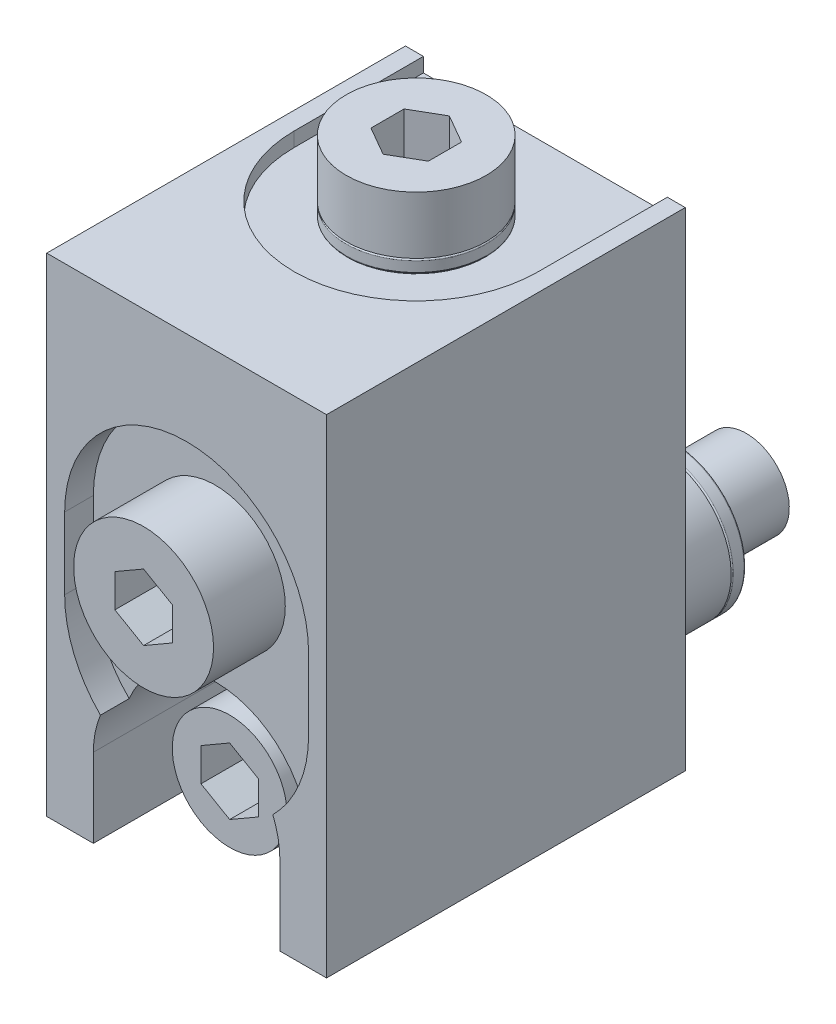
from build123d import *

# Parameters (mm, degrees)
SKETCH1_W           = 19.5
SKETCH1_H           = 34
BOSS_EXTRUDE1_DEPTH = 25
CUT_EXTRUDE1_DEPTH  = 10
CUT_EXTRUDE2_DEPTH  = 2
CUT_EXTRUDE3_DEPTH  = 1
SKETCH5_R           = 4
BOSS_EXTRUDE2_DEPTH = 7
SKETCH6_R           = 4.875
BOSS_EXTRUDE3_DEPTH = 5
SKETCH7_R           = 4.875
BOSS_EXTRUDE4_DEPTH = 5
CUT_EXTRUDE4_DEPTH  = 5
CUT_EXTRUDE5_DEPTH  = 3
CUT_EXTRUDE6_DEPTH  = 3
SKETCH16_W          = 0.1
SKETCH16_H          = 0.05
FILLET1_R           = 0.099


with BuildPart() as part:
    # Sketch1 → Boss-Extrude1 (new body)
    with BuildSketch(Plane.XY):
        with Locations((9.75, 17)):
            Rectangle(SKETCH1_W, SKETCH1_H)
    extrude(amount=BOSS_EXTRUDE1_DEPTH)

    # Sketch2 → Cut-Extrude1 (cut)
    with BuildSketch(Plane.XY.offset(25)):
        with BuildLine():
            Line((3.25, 5.5), (3.25, 0))
            Line((3.25, 0), (16.25, 0))
            Line((16.25, 0), (16.25, 5.5))
            ThreePointArc((16.25, 5.5), (9.75, 12), (3.25, 5.5))
        make_face()
    extrude(amount=-CUT_EXTRUDE1_DEPTH, mode=Mode.SUBTRACT)

    # Sketch3 → Cut-Extrude2 (cut)
    with BuildSketch(Plane.XY.offset(25)):
        with BuildLine():
            Line((1.25, 19), (1.25, 14))
            ThreePointArc((1.25, 14), (9.75, 5.5), (18.25, 14))
            Line((18.25, 14), (18.25, 19))
            ThreePointArc((18.25, 19), (9.75, 27.5), (1.25, 19))
        make_face()
    extrude(amount=-CUT_EXTRUDE2_DEPTH, mode=Mode.SUBTRACT)

    # Sketch4 → Cut-Extrude3 (cut)
    with BuildSketch(Plane(origin=(0, 34, 0), x_dir=(1, 0, 0), z_dir=(0, 1, 0))):
        with BuildLine():
            Line((1.25, -9), (1.25, 0))
            Line((1.25, 0), (18.25, 0))
            Line((18.25, 0), (18.25, -9))
            ThreePointArc((18.25, -9), (9.75, -17.5), (1.25, -9))
        make_face()
    extrude(amount=-CUT_EXTRUDE3_DEPTH, mode=Mode.SUBTRACT)

    # Sketch5 → Boss-Extrude2 (add)
    with BuildSketch(Plane.XY.offset(15)):
        with Locations((9.75, 5.5)):
            Circle(SKETCH5_R)
    extrude(amount=BOSS_EXTRUDE2_DEPTH)

    # Sketch6 → Boss-Extrude3 (add)
    with BuildSketch(Plane.XY.offset(23)):
        with Locations((9.75, 19)):
            Circle(SKETCH6_R)
    extrude(amount=BOSS_EXTRUDE3_DEPTH)

    # Sketch7 → Boss-Extrude4 (add)
    with BuildSketch(Plane(origin=(0, 33, 0), x_dir=(1, 0, 0), z_dir=(0, 1, 0))):
        with Locations(Location((9.75, -9, 0), (0, 0, 270))):
            Circle(SKETCH7_R)
    extrude(amount=BOSS_EXTRUDE4_DEPTH)

    # Sketch8 → Cut-Extrude4 (cut)
    with BuildSketch(Plane.XY.offset(22)):
        Polygon((9.75, 3.190598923), (11.75, 4.345299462), (11.75, 6.654700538), (9.75, 7.809401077), (7.75, 6.654700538), (7.75, 4.345299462), align=None)
    extrude(amount=-CUT_EXTRUDE4_DEPTH, mode=Mode.SUBTRACT)

    # Sketch9 → Cut-Extrude5 (cut)
    with BuildSketch(Plane.XY.offset(28)):
        Polygon((9.75, 16.690598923), (11.75, 17.845299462), (11.75, 20.154700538), (9.75, 21.309401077), (7.75, 20.154700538), (7.75, 17.845299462), align=None)
    extrude(amount=-CUT_EXTRUDE5_DEPTH, mode=Mode.SUBTRACT)

    # Sketch10 → Cut-Extrude6 (cut)
    with BuildSketch(Plane(origin=(0, 38, 0), x_dir=(1, 0, 0), z_dir=(0, 1, 0))):
        Polygon((9.75, -11.309401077), (11.75, -10.154700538), (11.75, -7.845299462), (9.75, -6.690598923), (7.75, -7.845299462), (7.75, -10.154700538), align=None)
    extrude(amount=-CUT_EXTRUDE6_DEPTH, mode=Mode.SUBTRACT)

    # Sketch12 → Revolve1 (revolve)
    with BuildSketch(Plane.ZY.offset(-9.75), mode=Mode.PRIVATE) as revolve1_sk:
        with BuildLine():
            Line((-8.851, 10.5), (-8.099, 10.5))
            ThreePointArc((-8.099, 10.5), (-8.028996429, 10.471003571), (-8, 10.401))
            Line((-8, 10.401), (-7.95, 10.4))
            Line((-7.95, 10.4), (-7.95, 10.5))
            Line((-7.95, 10.5), (-1.05, 10.5))
            Line((-1.05, 10.5), (-1.05, 10.4))
            Line((-1.05, 10.4), (-1, 10.401))
            ThreePointArc((-1, 10.401), (-0.971003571, 10.471003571), (-0.901, 10.5))
            Line((-0.901, 10.5), (-0.149, 10.5))
            ThreePointArc((-0.149, 10.5), (-0.078996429, 10.471003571), (-0.05, 10.4))
            Line((-0.05, 10.4), (0, 10.4))
            Line((0, 10.4), (0, 6.5))
            Line((0, 6.5), (-14, 6.5))
            Line((-14, 6.5), (-14, 8.5))
            Line((-14, 8.5), (-9, 8.5))
            Line((-9, 8.5), (-9, 9.5))
            Line((-9, 9.5), (-8.95, 9.5))
            Line((-8.95, 9.5), (-8.95, 10.401))
            ThreePointArc((-8.95, 10.401), (-8.921003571, 10.471003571), (-8.851, 10.5))
        make_face()
    revolve(revolve1_sk.sketch.rotate(Axis((9.75, 5.5, 0), (0, 0, -1)), 180), axis=Axis((9.75, 5.5, 0), (0, 0, -1)))

    # Sketch16 → Cut-Revolve1 (revolve, cut)
    with BuildSketch(Plane.ZY.offset(-9.75), mode=Mode.PRIVATE) as cut_revolve1_sk:
        with Locations((4.175, 33.025)):
            Rectangle(SKETCH16_W, SKETCH16_H)
        with Locations((4.175, 33.975)):
            Rectangle(SKETCH16_W, SKETCH16_H)
    revolve(cut_revolve1_sk.sketch.rotate(Axis((9.75, 38, 9), (0, -1, 0)), 180), axis=Axis((9.75, 38, 9), (0, -1, 0)), mode=Mode.SUBTRACT)

    # Fillet1
    fillet1_edges = [part.edges().sort_by_distance(p)[0] for p in [
        (9.75, 33.05, 4.125),
        (9.75, 33.95, 4.125),
    ]]
    fillet(fillet1_edges, radius=FILLET1_R)


solid = part.part
